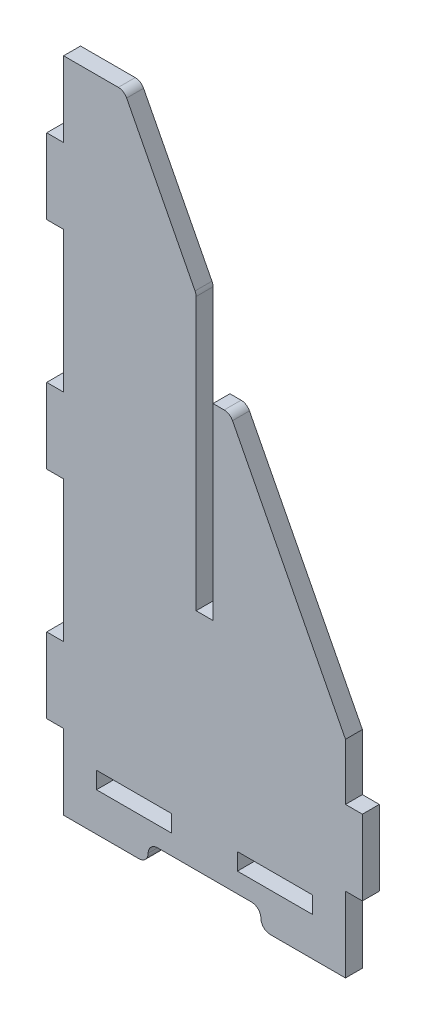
ISO-10303-21;
HEADER;
FILE_DESCRIPTION(('STEP AP214'),'2;1');
FILE_NAME('part.step','',(''),(''),'','','');
FILE_SCHEMA(('AUTOMOTIVE_DESIGN { 1 0 10303 214 1 1 1 1 }'));
ENDSEC;
DATA;
#1=APPLICATION_CONTEXT('core data for automotive mechanical design processes');
#2=APPLICATION_PROTOCOL_DEFINITION('international standard','automotive_design',2000,#1);
#3=PRODUCT_CONTEXT('',#1,'mechanical');
#4=PRODUCT('Part','Part','',(#3));
#5=PRODUCT_RELATED_PRODUCT_CATEGORY('part','',(#4));
#6=PRODUCT_DEFINITION_FORMATION('','',#4);
#7=PRODUCT_DEFINITION_CONTEXT('part definition',#1,'design');
#8=PRODUCT_DEFINITION('design','',#6,#7);
#9=PRODUCT_DEFINITION_SHAPE('','',#8);
#10=(LENGTH_UNIT() NAMED_UNIT(*) SI_UNIT(.MILLI.,.METRE.));
#11=(NAMED_UNIT(*) PLANE_ANGLE_UNIT() SI_UNIT($,.RADIAN.));
#12=(NAMED_UNIT(*) SI_UNIT($,.STERADIAN.) SOLID_ANGLE_UNIT());
#13=UNCERTAINTY_MEASURE_WITH_UNIT(LENGTH_MEASURE(1.E-05),#10,'distance_accuracy_value','');
#14=(GEOMETRIC_REPRESENTATION_CONTEXT(3) GLOBAL_UNCERTAINTY_ASSIGNED_CONTEXT((#13)) GLOBAL_UNIT_ASSIGNED_CONTEXT((#10,
#11,#12)) REPRESENTATION_CONTEXT('',''));
#15=CARTESIAN_POINT('',(0.,0.,0.));
#16=DIRECTION('',(0.,0.,1.));
#17=DIRECTION('',(1.,0.,0.));
#18=AXIS2_PLACEMENT_3D('',#15,#16,#17);
#19=CARTESIAN_POINT('',(-150.,350.,18.));
#20=DIRECTION('',(1.,0.,0.));
#21=DIRECTION('',(0.,1.,0.));
#22=AXIS2_PLACEMENT_3D('',#19,#20,#21);
#23=PLANE('',#22);
#24=DIRECTION('',(0.,-1.,0.));
#25=VECTOR('',#24,1.);
#26=CARTESIAN_POINT('',(-150.,350.,18.));
#27=LINE('',#26,#25);
#28=CARTESIAN_POINT('',(-150.,190.,18.));
#29=VERTEX_POINT('',#28);
#30=CARTESIAN_POINT('',(-150.,40.,18.));
#31=VERTEX_POINT('',#30);
#32=EDGE_CURVE('E545',#29,#31,#27,.T.);
#33=ORIENTED_EDGE('',*,*,#32,.F.);
#34=DIRECTION('',(0.,0.,-1.));
#35=VECTOR('',#34,1.);
#36=CARTESIAN_POINT('',(-150.,190.,18.));
#37=LINE('',#36,#35);
#38=CARTESIAN_POINT('',(-150.,190.,0.));
#39=VERTEX_POINT('',#38);
#40=EDGE_CURVE('E358',#29,#39,#37,.T.);
#41=ORIENTED_EDGE('',*,*,#40,.T.);
#42=DIRECTION('',(0.,-1.,0.));
#43=VECTOR('',#42,1.);
#44=CARTESIAN_POINT('',(-150.,350.,0.));
#45=LINE('',#44,#43);
#46=CARTESIAN_POINT('',(-150.,40.,0.));
#47=VERTEX_POINT('',#46);
#48=EDGE_CURVE('E565',#39,#47,#45,.T.);
#49=ORIENTED_EDGE('',*,*,#48,.T.);
#50=DIRECTION('',(0.,0.,-1.));
#51=VECTOR('',#50,1.);
#52=CARTESIAN_POINT('',(-150.,40.,18.));
#53=LINE('',#52,#51);
#54=EDGE_CURVE('E386',#31,#47,#53,.T.);
#55=ORIENTED_EDGE('',*,*,#54,.F.);
#56=EDGE_LOOP('',(#33,#41,#49,#55));
#57=FACE_BOUND('',#56,.T.);
#58=ADVANCED_FACE('F33',(#57),#23,.F.);
#59=CARTESIAN_POINT('',(-150.,350.,0.));
#60=VERTEX_POINT('',#59);
#61=CARTESIAN_POINT('',(-150.,270.,0.));
#62=VERTEX_POINT('',#61);
#63=EDGE_CURVE('E563',#60,#62,#45,.T.);
#64=ORIENTED_EDGE('',*,*,#63,.T.);
#65=DIRECTION('',(0.,0.,-1.));
#66=VECTOR('',#65,1.);
#67=CARTESIAN_POINT('',(-150.,270.,18.));
#68=LINE('',#67,#66);
#69=CARTESIAN_POINT('',(-150.,270.,18.));
#70=VERTEX_POINT('',#69);
#71=EDGE_CURVE('E362',#70,#62,#68,.T.);
#72=ORIENTED_EDGE('',*,*,#71,.F.);
#73=CARTESIAN_POINT('',(-150.,350.,18.));
#74=VERTEX_POINT('',#73);
#75=EDGE_CURVE('E541',#74,#70,#27,.T.);
#76=ORIENTED_EDGE('',*,*,#75,.F.);
#77=DIRECTION('',(0.,0.,-1.));
#78=VECTOR('',#77,1.);
#79=CARTESIAN_POINT('',(-150.,350.,18.));
#80=LINE('',#79,#78);
#81=EDGE_CURVE('E568',#74,#60,#80,.T.);
#82=ORIENTED_EDGE('',*,*,#81,.T.);
#83=EDGE_LOOP('',(#64,#72,#76,#82));
#84=FACE_BOUND('',#83,.T.);
#85=ADVANCED_FACE('F747',(#84),#23,.F.);
#86=DIRECTION('',(0.,0.,1.));
#87=VECTOR('',#86,1.);
#88=CARTESIAN_POINT('',(-150.,-270.,0.));
#89=LINE('',#88,#87);
#90=CARTESIAN_POINT('',(-150.,-270.,0.));
#91=VERTEX_POINT('',#90);
#92=CARTESIAN_POINT('',(-150.,-270.,18.));
#93=VERTEX_POINT('',#92);
#94=EDGE_CURVE('E481',#91,#93,#89,.T.);
#95=ORIENTED_EDGE('',*,*,#94,.F.);
#96=CARTESIAN_POINT('',(-150.,-350.,0.));
#97=VERTEX_POINT('',#96);
#98=EDGE_CURVE('E562',#91,#97,#45,.T.);
#99=ORIENTED_EDGE('',*,*,#98,.T.);
#100=DIRECTION('',(0.,0.,-1.));
#101=VECTOR('',#100,1.);
#102=CARTESIAN_POINT('',(-150.,-350.,18.));
#103=LINE('',#102,#101);
#104=CARTESIAN_POINT('',(-150.,-350.,18.));
#105=VERTEX_POINT('',#104);
#106=EDGE_CURVE('E544',#105,#97,#103,.T.);
#107=ORIENTED_EDGE('',*,*,#106,.F.);
#108=EDGE_CURVE('E540',#93,#105,#27,.T.);
#109=ORIENTED_EDGE('',*,*,#108,.F.);
#110=EDGE_LOOP('',(#95,#99,#107,#109));
#111=FACE_BOUND('',#110,.T.);
#112=ADVANCED_FACE('F704',(#111),#23,.F.);
#113=CARTESIAN_POINT('',(150.,-350.,18.));
#114=DIRECTION('',(-1.,0.,0.));
#115=DIRECTION('',(0.,-1.,0.));
#116=AXIS2_PLACEMENT_3D('',#113,#114,#115);
#117=PLANE('',#116);
#118=DIRECTION('',(0.,0.,1.));
#119=VECTOR('',#118,1.);
#120=CARTESIAN_POINT('',(150.,-190.,0.));
#121=LINE('',#120,#119);
#122=CARTESIAN_POINT('',(150.,-190.,0.));
#123=VERTEX_POINT('',#122);
#124=CARTESIAN_POINT('',(150.,-190.,18.));
#125=VERTEX_POINT('',#124);
#126=EDGE_CURVE('E503',#123,#125,#121,.T.);
#127=ORIENTED_EDGE('',*,*,#126,.F.);
#128=DIRECTION('',(0.,1.,0.));
#129=VECTOR('',#128,1.);
#130=CARTESIAN_POINT('',(150.,-350.,0.));
#131=LINE('',#130,#129);
#132=CARTESIAN_POINT('',(150.,-130.,0.));
#133=VERTEX_POINT('',#132);
#134=EDGE_CURVE('E549',#123,#133,#131,.T.);
#135=ORIENTED_EDGE('',*,*,#134,.T.);
#136=DIRECTION('',(0.,0.,-1.));
#137=VECTOR('',#136,1.);
#138=CARTESIAN_POINT('',(150.,-130.,18.));
#139=LINE('',#138,#137);
#140=CARTESIAN_POINT('',(150.,-130.,18.));
#141=VERTEX_POINT('',#140);
#142=EDGE_CURVE('E571',#141,#133,#139,.T.);
#143=ORIENTED_EDGE('',*,*,#142,.F.);
#144=DIRECTION('',(0.,1.,0.));
#145=VECTOR('',#144,1.);
#146=CARTESIAN_POINT('',(150.,-350.,18.));
#147=LINE('',#146,#145);
#148=EDGE_CURVE('E523',#125,#141,#147,.T.);
#149=ORIENTED_EDGE('',*,*,#148,.F.);
#150=EDGE_LOOP('',(#127,#135,#143,#149));
#151=FACE_BOUND('',#150,.T.);
#152=ADVANCED_FACE('F649',(#151),#117,.F.);
#153=CARTESIAN_POINT('',(-150.,-350.,18.));
#154=DIRECTION('',(0.,1.,0.));
#155=DIRECTION('',(0.,0.,1.));
#156=AXIS2_PLACEMENT_3D('',#153,#154,#155);
#157=PLANE('',#156);
#158=DIRECTION('',(1.,0.,0.));
#159=VECTOR('',#158,1.);
#160=CARTESIAN_POINT('',(-150.,-350.,18.));
#161=LINE('',#160,#159);
#162=CARTESIAN_POINT('',(70.,-350.,18.));
#163=VERTEX_POINT('',#162);
#164=CARTESIAN_POINT('',(150.,-350.,18.));
#165=VERTEX_POINT('',#164);
#166=EDGE_CURVE('E524',#163,#165,#161,.T.);
#167=ORIENTED_EDGE('',*,*,#166,.F.);
#168=DIRECTION('',(0.,0.,1.));
#169=VECTOR('',#168,1.);
#170=CARTESIAN_POINT('',(70.,-350.,18.));
#171=LINE('',#170,#169);
#172=CARTESIAN_POINT('',(70.,-350.,0.));
#173=VERTEX_POINT('',#172);
#174=EDGE_CURVE('E586',#163,#173,#171,.F.);
#175=ORIENTED_EDGE('',*,*,#174,.T.);
#176=DIRECTION('',(1.,0.,0.));
#177=VECTOR('',#176,1.);
#178=CARTESIAN_POINT('',(-150.,-350.,0.));
#179=LINE('',#178,#177);
#180=CARTESIAN_POINT('',(150.,-350.,0.));
#181=VERTEX_POINT('',#180);
#182=EDGE_CURVE('E515',#173,#181,#179,.T.);
#183=ORIENTED_EDGE('',*,*,#182,.T.);
#184=DIRECTION('',(0.,0.,-1.));
#185=VECTOR('',#184,1.);
#186=CARTESIAN_POINT('',(150.,-350.,18.));
#187=LINE('',#186,#185);
#188=EDGE_CURVE('E574',#165,#181,#187,.T.);
#189=ORIENTED_EDGE('',*,*,#188,.F.);
#190=EDGE_LOOP('',(#167,#175,#183,#189));
#191=FACE_BOUND('',#190,.T.);
#192=ADVANCED_FACE('F668',(#191),#157,.F.);
#193=CARTESIAN_POINT('',(-70.,-350.,0.));
#194=VERTEX_POINT('',#193);
#195=EDGE_CURVE('E546',#97,#194,#179,.T.);
#196=ORIENTED_EDGE('',*,*,#195,.T.);
#197=DIRECTION('',(0.,0.,1.));
#198=VECTOR('',#197,1.);
#199=CARTESIAN_POINT('',(-70.,-350.,18.));
#200=LINE('',#199,#198);
#201=CARTESIAN_POINT('',(-70.,-350.,18.));
#202=VERTEX_POINT('',#201);
#203=EDGE_CURVE('E592',#194,#202,#200,.T.);
#204=ORIENTED_EDGE('',*,*,#203,.T.);
#205=EDGE_CURVE('E520',#105,#202,#161,.T.);
#206=ORIENTED_EDGE('',*,*,#205,.F.);
#207=ORIENTED_EDGE('',*,*,#106,.T.);
#208=EDGE_LOOP('',(#196,#204,#206,#207));
#209=FACE_BOUND('',#208,.T.);
#210=ADVANCED_FACE('F695',(#209),#157,.F.);
#211=CARTESIAN_POINT('',(150.,-270.,0.));
#212=VERTEX_POINT('',#211);
#213=EDGE_CURVE('E550',#181,#212,#131,.T.);
#214=ORIENTED_EDGE('',*,*,#213,.T.);
#215=DIRECTION('',(0.,0.,1.));
#216=VECTOR('',#215,1.);
#217=CARTESIAN_POINT('',(150.,-270.,0.));
#218=LINE('',#217,#216);
#219=CARTESIAN_POINT('',(150.,-270.,18.));
#220=VERTEX_POINT('',#219);
#221=EDGE_CURVE('E495',#212,#220,#218,.T.);
#222=ORIENTED_EDGE('',*,*,#221,.T.);
#223=EDGE_CURVE('E525',#165,#220,#147,.T.);
#224=ORIENTED_EDGE('',*,*,#223,.F.);
#225=ORIENTED_EDGE('',*,*,#188,.T.);
#226=EDGE_LOOP('',(#214,#222,#224,#225));
#227=FACE_BOUND('',#226,.T.);
#228=ADVANCED_FACE('F663',(#227),#117,.F.);
#229=CARTESIAN_POINT('',(150.,-130.,18.));
#230=DIRECTION('',(-0.889158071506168,-0.45760017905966,0.));
#231=DIRECTION('',(0.45760017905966,-0.889158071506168,0.));
#232=AXIS2_PLACEMENT_3D('',#229,#230,#231);
#233=PLANE('',#232);
#234=DIRECTION('',(-0.45760017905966,0.889158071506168,0.));
#235=VECTOR('',#234,1.);
#236=CARTESIAN_POINT('',(150.,-130.,0.));
#237=LINE('',#236,#235);
#238=CARTESIAN_POINT('',(29.7914300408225,103.576001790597,0.));
#239=VERTEX_POINT('',#238);
#240=EDGE_CURVE('E553',#133,#239,#237,.T.);
#241=ORIENTED_EDGE('',*,*,#240,.T.);
#242=DIRECTION('',(0.,0.,-1.));
#243=VECTOR('',#242,1.);
#244=CARTESIAN_POINT('',(29.7914300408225,103.576001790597,18.));
#245=LINE('',#244,#243);
#246=CARTESIAN_POINT('',(29.7914300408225,103.576001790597,18.));
#247=VERTEX_POINT('',#246);
#248=EDGE_CURVE('E11',#239,#247,#245,.F.);
#249=ORIENTED_EDGE('',*,*,#248,.T.);
#250=DIRECTION('',(-0.45760017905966,0.889158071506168,0.));
#251=VECTOR('',#250,1.);
#252=CARTESIAN_POINT('',(150.,-130.,18.));
#253=LINE('',#252,#251);
#254=EDGE_CURVE('E528',#141,#247,#253,.T.);
#255=ORIENTED_EDGE('',*,*,#254,.F.);
#256=ORIENTED_EDGE('',*,*,#142,.T.);
#257=EDGE_LOOP('',(#241,#249,#255,#256));
#258=FACE_BOUND('',#257,.T.);
#259=ADVANCED_FACE('F638',(#258),#233,.F.);
#260=CARTESIAN_POINT('',(26.9999999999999,109.,18.));
#261=DIRECTION('',(0.,-1.,0.));
#262=DIRECTION('',(1.,0.,0.));
#263=AXIS2_PLACEMENT_3D('',#260,#261,#262);
#264=PLANE('',#263);
#265=DIRECTION('',(-1.,0.,0.));
#266=VECTOR('',#265,1.);
#267=CARTESIAN_POINT('',(26.9999999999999,109.,0.));
#268=LINE('',#267,#266);
#269=CARTESIAN_POINT('',(20.8998493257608,109.,0.));
#270=VERTEX_POINT('',#269);
#271=CARTESIAN_POINT('',(8.99999999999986,109.,0.));
#272=VERTEX_POINT('',#271);
#273=EDGE_CURVE('E316',#270,#272,#268,.T.);
#274=ORIENTED_EDGE('',*,*,#273,.T.);
#275=DIRECTION('',(0.,0.,1.));
#276=VECTOR('',#275,1.);
#277=CARTESIAN_POINT('',(8.99999999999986,109.,0.));
#278=LINE('',#277,#276);
#279=CARTESIAN_POINT('',(8.99999999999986,109.,18.));
#280=VERTEX_POINT('',#279);
#281=EDGE_CURVE('E335',#272,#280,#278,.T.);
#282=ORIENTED_EDGE('',*,*,#281,.T.);
#283=DIRECTION('',(-1.,0.,0.));
#284=VECTOR('',#283,1.);
#285=CARTESIAN_POINT('',(26.9999999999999,109.,18.));
#286=LINE('',#285,#284);
#287=CARTESIAN_POINT('',(20.8998493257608,109.,18.));
#288=VERTEX_POINT('',#287);
#289=EDGE_CURVE('E531',#288,#280,#286,.T.);
#290=ORIENTED_EDGE('',*,*,#289,.F.);
#291=DIRECTION('',(0.,0.,-1.));
#292=VECTOR('',#291,1.);
#293=CARTESIAN_POINT('',(20.8998493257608,109.,18.));
#294=LINE('',#293,#292);
#295=EDGE_CURVE('E41',#288,#270,#294,.T.);
#296=ORIENTED_EDGE('',*,*,#295,.T.);
#297=EDGE_LOOP('',(#274,#282,#290,#296));
#298=FACE_BOUND('',#297,.T.);
#299=ADVANCED_FACE('F631',(#298),#264,.F.);
#300=CARTESIAN_POINT('',(-9.00000000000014,109.,18.));
#301=DIRECTION('',(-1.,0.,0.));
#302=DIRECTION('',(0.,0.,1.));
#303=AXIS2_PLACEMENT_3D('',#300,#301,#302);
#304=PLANE('',#303);
#305=DIRECTION('',(0.,1.,0.));
#306=VECTOR('',#305,1.);
#307=CARTESIAN_POINT('',(-9.00000000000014,109.,0.));
#308=LINE('',#307,#306);
#309=CARTESIAN_POINT('',(-9.00000000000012,-91.,0.));
#310=VERTEX_POINT('',#309);
#311=CARTESIAN_POINT('',(-9.00000000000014,198.594774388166,0.));
#312=VERTEX_POINT('',#311);
#313=EDGE_CURVE('E307',#310,#312,#308,.T.);
#314=ORIENTED_EDGE('',*,*,#313,.T.);
#315=DIRECTION('',(0.,0.,-1.));
#316=VECTOR('',#315,1.);
#317=CARTESIAN_POINT('',(-9.00000000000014,198.594774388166,18.));
#318=LINE('',#317,#316);
#319=CARTESIAN_POINT('',(-9.00000000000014,198.594774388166,18.));
#320=VERTEX_POINT('',#319);
#321=EDGE_CURVE('E56',#312,#320,#318,.F.);
#322=ORIENTED_EDGE('',*,*,#321,.T.);
#323=DIRECTION('',(0.,1.,0.));
#324=VECTOR('',#323,1.);
#325=CARTESIAN_POINT('',(-9.00000000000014,109.,18.));
#326=LINE('',#325,#324);
#327=CARTESIAN_POINT('',(-9.00000000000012,-91.,18.));
#328=VERTEX_POINT('',#327);
#329=EDGE_CURVE('E321',#328,#320,#326,.T.);
#330=ORIENTED_EDGE('',*,*,#329,.F.);
#331=DIRECTION('',(0.,0.,1.));
#332=VECTOR('',#331,1.);
#333=CARTESIAN_POINT('',(-9.00000000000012,-91.,0.));
#334=LINE('',#333,#332);
#335=EDGE_CURVE('E319',#310,#328,#334,.T.);
#336=ORIENTED_EDGE('',*,*,#335,.F.);
#337=EDGE_LOOP('',(#314,#322,#330,#336));
#338=FACE_BOUND('',#337,.T.);
#339=ADVANCED_FACE('F320',(#338),#304,.F.);
#340=CARTESIAN_POINT('',(-9.00000000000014,201.017473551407,18.));
#341=DIRECTION('',(-0.889118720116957,-0.457676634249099,0.));
#342=DIRECTION('',(0.457676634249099,-0.889118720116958,0.));
#343=AXIS2_PLACEMENT_3D('',#340,#341,#342);
#344=PLANE('',#343);
#345=DIRECTION('',(-0.457676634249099,0.889118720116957,0.));
#346=VECTOR('',#345,1.);
#347=CARTESIAN_POINT('',(-9.00000000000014,201.017473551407,0.));
#348=LINE('',#347,#346);
#349=CARTESIAN_POINT('',(-10.1088127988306,203.171540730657,0.));
#350=VERTEX_POINT('',#349);
#351=CARTESIAN_POINT('',(-82.8975937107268,344.576766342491,0.));
#352=VERTEX_POINT('',#351);
#353=EDGE_CURVE('E315',#350,#352,#348,.T.);
#354=ORIENTED_EDGE('',*,*,#353,.T.);
#355=DIRECTION('',(0.,0.,-1.));
#356=VECTOR('',#355,1.);
#357=CARTESIAN_POINT('',(-82.8975937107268,344.576766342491,18.));
#358=LINE('',#357,#356);
#359=CARTESIAN_POINT('',(-82.8975937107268,344.576766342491,18.));
#360=VERTEX_POINT('',#359);
#361=EDGE_CURVE('E618',#352,#360,#358,.F.);
#362=ORIENTED_EDGE('',*,*,#361,.T.);
#363=DIRECTION('',(-0.457676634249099,0.889118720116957,0.));
#364=VECTOR('',#363,1.);
#365=CARTESIAN_POINT('',(-9.00000000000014,201.017473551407,18.));
#366=LINE('',#365,#364);
#367=CARTESIAN_POINT('',(-10.1088127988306,203.171540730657,18.));
#368=VERTEX_POINT('',#367);
#369=EDGE_CURVE('E535',#368,#360,#366,.T.);
#370=ORIENTED_EDGE('',*,*,#369,.F.);
#371=DIRECTION('',(0.,0.,-1.));
#372=VECTOR('',#371,1.);
#373=CARTESIAN_POINT('',(-10.1088127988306,203.171540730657,18.));
#374=LINE('',#373,#372);
#375=EDGE_CURVE('E615',#368,#350,#374,.T.);
#376=ORIENTED_EDGE('',*,*,#375,.T.);
#377=EDGE_LOOP('',(#354,#362,#370,#376));
#378=FACE_BOUND('',#377,.T.);
#379=ADVANCED_FACE('F742',(#378),#344,.F.);
#380=CARTESIAN_POINT('',(-150.,350.,18.));
#381=DIRECTION('',(0.,-1.,0.));
#382=DIRECTION('',(0.,0.,-1.));
#383=AXIS2_PLACEMENT_3D('',#380,#381,#382);
#384=PLANE('',#383);
#385=DIRECTION('',(-1.,0.,0.));
#386=VECTOR('',#385,1.);
#387=CARTESIAN_POINT('',(-150.,350.,18.));
#388=LINE('',#387,#386);
#389=CARTESIAN_POINT('',(-91.7887809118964,350.,18.));
#390=VERTEX_POINT('',#389);
#391=EDGE_CURVE('E538',#390,#74,#388,.T.);
#392=ORIENTED_EDGE('',*,*,#391,.F.);
#393=DIRECTION('',(0.,0.,-1.));
#394=VECTOR('',#393,1.);
#395=CARTESIAN_POINT('',(-91.7887809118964,350.,18.));
#396=LINE('',#395,#394);
#397=CARTESIAN_POINT('',(-91.7887809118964,350.,0.));
#398=VERTEX_POINT('',#397);
#399=EDGE_CURVE('E603',#390,#398,#396,.T.);
#400=ORIENTED_EDGE('',*,*,#399,.T.);
#401=DIRECTION('',(-1.,0.,0.));
#402=VECTOR('',#401,1.);
#403=CARTESIAN_POINT('',(-150.,350.,0.));
#404=LINE('',#403,#402);
#405=EDGE_CURVE('E560',#398,#60,#404,.T.);
#406=ORIENTED_EDGE('',*,*,#405,.T.);
#407=ORIENTED_EDGE('',*,*,#81,.F.);
#408=EDGE_LOOP('',(#392,#400,#406,#407));
#409=FACE_BOUND('',#408,.T.);
#410=ADVANCED_FACE('F733',(#409),#384,.F.);
#411=CARTESIAN_POINT('',(-150.,-40.,18.));
#412=VERTEX_POINT('',#411);
#413=CARTESIAN_POINT('',(-150.,-190.,18.));
#414=VERTEX_POINT('',#413);
#415=EDGE_CURVE('E703',#412,#414,#27,.T.);
#416=ORIENTED_EDGE('',*,*,#415,.F.);
#417=DIRECTION('',(0.,0.,-1.));
#418=VECTOR('',#417,1.);
#419=CARTESIAN_POINT('',(-150.,-40.,18.));
#420=LINE('',#419,#418);
#421=CARTESIAN_POINT('',(-150.,-40.,0.));
#422=VERTEX_POINT('',#421);
#423=EDGE_CURVE('E378',#412,#422,#420,.T.);
#424=ORIENTED_EDGE('',*,*,#423,.T.);
#425=CARTESIAN_POINT('',(-150.,-190.,0.));
#426=VERTEX_POINT('',#425);
#427=EDGE_CURVE('E706',#422,#426,#45,.T.);
#428=ORIENTED_EDGE('',*,*,#427,.T.);
#429=DIRECTION('',(0.,0.,1.));
#430=VECTOR('',#429,1.);
#431=CARTESIAN_POINT('',(-150.,-190.,0.));
#432=LINE('',#431,#430);
#433=EDGE_CURVE('E477',#426,#414,#432,.T.);
#434=ORIENTED_EDGE('',*,*,#433,.T.);
#435=EDGE_LOOP('',(#416,#424,#428,#434));
#436=FACE_BOUND('',#435,.T.);
#437=ADVANCED_FACE('F731',(#436),#23,.F.);
#438=CARTESIAN_POINT('',(0.,0.,18.));
#439=DIRECTION('',(0.,0.,1.));
#440=DIRECTION('',(1.,0.,0.));
#441=AXIS2_PLACEMENT_3D('',#438,#439,#440);
#442=PLANE('',#441);
#443=DIRECTION('',(1.,0.,0.));
#444=VECTOR('',#443,1.);
#445=CARTESIAN_POINT('',(-9.00000000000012,-91.,18.));
#446=LINE('',#445,#444);
#447=CARTESIAN_POINT('',(8.99999999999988,-91.,18.));
#448=VERTEX_POINT('',#447);
#449=EDGE_CURVE('E331',#328,#448,#446,.T.);
#450=ORIENTED_EDGE('',*,*,#449,.F.);
#451=ORIENTED_EDGE('',*,*,#329,.T.);
#452=CARTESIAN_POINT('',(-19.0000000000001,198.594774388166,18.));
#453=DIRECTION('',(0.,0.,1.));
#454=DIRECTION('',(1.,0.,0.));
#455=AXIS2_PLACEMENT_3D('',#452,#453,#454);
#456=CIRCLE('',#455,10.);
#457=EDGE_CURVE('E622',#320,#368,#456,.T.);
#458=ORIENTED_EDGE('',*,*,#457,.T.);
#459=ORIENTED_EDGE('',*,*,#369,.T.);
#460=CARTESIAN_POINT('',(-91.7887809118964,340.,18.));
#461=DIRECTION('',(0.,0.,1.));
#462=DIRECTION('',(1.,0.,0.));
#463=AXIS2_PLACEMENT_3D('',#460,#461,#462);
#464=CIRCLE('',#463,10.);
#465=EDGE_CURVE('E624',#360,#390,#464,.T.);
#466=ORIENTED_EDGE('',*,*,#465,.T.);
#467=ORIENTED_EDGE('',*,*,#391,.T.);
#468=ORIENTED_EDGE('',*,*,#75,.T.);
#469=DIRECTION('',(1.,0.,0.));
#470=VECTOR('',#469,1.);
#471=CARTESIAN_POINT('',(-168.,270.,18.));
#472=LINE('',#471,#470);
#473=CARTESIAN_POINT('',(-168.,270.,18.));
#474=VERTEX_POINT('',#473);
#475=EDGE_CURVE('E347',#474,#70,#472,.T.);
#476=ORIENTED_EDGE('',*,*,#475,.F.);
#477=DIRECTION('',(0.,1.,0.));
#478=VECTOR('',#477,1.);
#479=CARTESIAN_POINT('',(-168.,190.,18.));
#480=LINE('',#479,#478);
#481=CARTESIAN_POINT('',(-168.,190.,18.));
#482=VERTEX_POINT('',#481);
#483=EDGE_CURVE('E343',#482,#474,#480,.T.);
#484=ORIENTED_EDGE('',*,*,#483,.F.);
#485=DIRECTION('',(-1.,0.,0.));
#486=VECTOR('',#485,1.);
#487=CARTESIAN_POINT('',(-168.,190.,18.));
#488=LINE('',#487,#486);
#489=EDGE_CURVE('E340',#29,#482,#488,.T.);
#490=ORIENTED_EDGE('',*,*,#489,.F.);
#491=ORIENTED_EDGE('',*,*,#32,.T.);
#492=DIRECTION('',(1.,0.,0.));
#493=VECTOR('',#492,1.);
#494=CARTESIAN_POINT('',(-168.,40.,18.));
#495=LINE('',#494,#493);
#496=CARTESIAN_POINT('',(-168.,40.,18.));
#497=VERTEX_POINT('',#496);
#498=EDGE_CURVE('E375',#497,#31,#495,.T.);
#499=ORIENTED_EDGE('',*,*,#498,.F.);
#500=DIRECTION('',(0.,1.,0.));
#501=VECTOR('',#500,1.);
#502=CARTESIAN_POINT('',(-168.,40.,18.));
#503=LINE('',#502,#501);
#504=CARTESIAN_POINT('',(-168.,-40.,18.));
#505=VERTEX_POINT('',#504);
#506=EDGE_CURVE('E371',#505,#497,#503,.T.);
#507=ORIENTED_EDGE('',*,*,#506,.F.);
#508=DIRECTION('',(-1.,0.,0.));
#509=VECTOR('',#508,1.);
#510=CARTESIAN_POINT('',(-168.,-40.,18.));
#511=LINE('',#510,#509);
#512=EDGE_CURVE('E368',#412,#505,#511,.T.);
#513=ORIENTED_EDGE('',*,*,#512,.F.);
#514=ORIENTED_EDGE('',*,*,#415,.T.);
#515=DIRECTION('',(-1.,0.,0.));
#516=VECTOR('',#515,1.);
#517=CARTESIAN_POINT('',(-150.,-190.,18.));
#518=LINE('',#517,#516);
#519=CARTESIAN_POINT('',(-168.,-190.,18.));
#520=VERTEX_POINT('',#519);
#521=EDGE_CURVE('E453',#414,#520,#518,.T.);
#522=ORIENTED_EDGE('',*,*,#521,.T.);
#523=DIRECTION('',(0.,-1.,0.));
#524=VECTOR('',#523,1.);
#525=CARTESIAN_POINT('',(-168.,-190.,18.));
#526=LINE('',#525,#524);
#527=CARTESIAN_POINT('',(-168.,-270.,18.));
#528=VERTEX_POINT('',#527);
#529=EDGE_CURVE('E472',#520,#528,#526,.T.);
#530=ORIENTED_EDGE('',*,*,#529,.T.);
#531=DIRECTION('',(1.,0.,0.));
#532=VECTOR('',#531,1.);
#533=CARTESIAN_POINT('',(-150.,-270.,18.));
#534=LINE('',#533,#532);
#535=EDGE_CURVE('E464',#528,#93,#534,.T.);
#536=ORIENTED_EDGE('',*,*,#535,.T.);
#537=ORIENTED_EDGE('',*,*,#108,.T.);
#538=ORIENTED_EDGE('',*,*,#205,.T.);
#539=CARTESIAN_POINT('',(-70.,-340.,18.));
#540=DIRECTION('',(0.,0.,1.));
#541=DIRECTION('',(1.,0.,0.));
#542=AXIS2_PLACEMENT_3D('',#539,#540,#541);
#543=CIRCLE('',#542,10.);
#544=CARTESIAN_POINT('',(-60.,-340.,18.));
#545=VERTEX_POINT('',#544);
#546=EDGE_CURVE('E582',#202,#545,#543,.T.);
#547=ORIENTED_EDGE('',*,*,#546,.T.);
#548=CARTESIAN_POINT('',(-50.,-340.,18.));
#549=DIRECTION('',(0.,0.,1.));
#550=DIRECTION('',(1.,0.,0.));
#551=AXIS2_PLACEMENT_3D('',#548,#549,#550);
#552=CIRCLE('',#551,10.);
#553=CARTESIAN_POINT('',(-50.,-330.,18.));
#554=VERTEX_POINT('',#553);
#555=EDGE_CURVE('E599',#545,#554,#552,.F.);
#556=ORIENTED_EDGE('',*,*,#555,.T.);
#557=DIRECTION('',(-1.,0.,0.));
#558=VECTOR('',#557,1.);
#559=CARTESIAN_POINT('',(-60.,-330.,18.));
#560=LINE('',#559,#558);
#561=CARTESIAN_POINT('',(50.,-330.,18.));
#562=VERTEX_POINT('',#561);
#563=EDGE_CURVE('E516',#562,#554,#560,.T.);
#564=ORIENTED_EDGE('',*,*,#563,.F.);
#565=CARTESIAN_POINT('',(50.,-340.,18.));
#566=DIRECTION('',(0.,0.,1.));
#567=DIRECTION('',(1.,0.,0.));
#568=AXIS2_PLACEMENT_3D('',#565,#566,#567);
#569=CIRCLE('',#568,10.);
#570=CARTESIAN_POINT('',(60.,-340.,18.));
#571=VERTEX_POINT('',#570);
#572=EDGE_CURVE('E595',#562,#571,#569,.F.);
#573=ORIENTED_EDGE('',*,*,#572,.T.);
#574=CARTESIAN_POINT('',(70.,-340.,18.));
#575=DIRECTION('',(0.,0.,1.));
#576=DIRECTION('',(1.,0.,0.));
#577=AXIS2_PLACEMENT_3D('',#574,#575,#576);
#578=CIRCLE('',#577,10.);
#579=EDGE_CURVE('E584',#571,#163,#578,.T.);
#580=ORIENTED_EDGE('',*,*,#579,.T.);
#581=ORIENTED_EDGE('',*,*,#166,.T.);
#582=ORIENTED_EDGE('',*,*,#223,.T.);
#583=DIRECTION('',(1.,0.,0.));
#584=VECTOR('',#583,1.);
#585=CARTESIAN_POINT('',(150.,-270.,18.));
#586=LINE('',#585,#584);
#587=CARTESIAN_POINT('',(168.,-270.,18.));
#588=VERTEX_POINT('',#587);
#589=EDGE_CURVE('E480',#220,#588,#586,.T.);
#590=ORIENTED_EDGE('',*,*,#589,.T.);
#591=DIRECTION('',(0.,1.,0.));
#592=VECTOR('',#591,1.);
#593=CARTESIAN_POINT('',(168.,-190.,18.));
#594=LINE('',#593,#592);
#595=CARTESIAN_POINT('',(168.,-190.,18.));
#596=VERTEX_POINT('',#595);
#597=EDGE_CURVE('E498',#588,#596,#594,.T.);
#598=ORIENTED_EDGE('',*,*,#597,.T.);
#599=DIRECTION('',(-1.,0.,0.));
#600=VECTOR('',#599,1.);
#601=CARTESIAN_POINT('',(150.,-190.,18.));
#602=LINE('',#601,#600);
#603=EDGE_CURVE('E490',#596,#125,#602,.T.);
#604=ORIENTED_EDGE('',*,*,#603,.T.);
#605=ORIENTED_EDGE('',*,*,#148,.T.);
#606=ORIENTED_EDGE('',*,*,#254,.T.);
#607=CARTESIAN_POINT('',(20.8998493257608,99.,18.));
#608=DIRECTION('',(0.,0.,1.));
#609=DIRECTION('',(1.,0.,0.));
#610=AXIS2_PLACEMENT_3D('',#607,#608,#609);
#611=CIRCLE('',#610,10.);
#612=EDGE_CURVE('E620',#247,#288,#611,.T.);
#613=ORIENTED_EDGE('',*,*,#612,.T.);
#614=ORIENTED_EDGE('',*,*,#289,.T.);
#615=DIRECTION('',(0.,1.,0.));
#616=VECTOR('',#615,1.);
#617=CARTESIAN_POINT('',(8.99999999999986,109.,18.));
#618=LINE('',#617,#616);
#619=EDGE_CURVE('E328',#448,#280,#618,.T.);
#620=ORIENTED_EDGE('',*,*,#619,.F.);
#621=EDGE_LOOP('',(#450,#451,#458,#459,#466,#467,#468,#476,#484,#490,#491,#499,#507,#513,#514,
#522,#530,#536,#537,#538,#547,#556,#564,#573,#580,#581,#582,#590,#598,#604,#605,#606,#613,#614,#620));
#622=FACE_BOUND('',#621,.T.);
#623=DIRECTION('',(0.,1.,0.));
#624=VECTOR('',#623,1.);
#625=CARTESIAN_POINT('',(-115.,-291.,18.));
#626=LINE('',#625,#624);
#627=CARTESIAN_POINT('',(-115.,-309.,18.));
#628=VERTEX_POINT('',#627);
#629=CARTESIAN_POINT('',(-115.,-291.,18.));
#630=VERTEX_POINT('',#629);
#631=EDGE_CURVE('E396',#628,#630,#626,.T.);
#632=ORIENTED_EDGE('',*,*,#631,.T.);
#633=DIRECTION('',(1.,0.,0.));
#634=VECTOR('',#633,1.);
#635=CARTESIAN_POINT('',(-115.,-291.,18.));
#636=LINE('',#635,#634);
#637=CARTESIAN_POINT('',(-35.,-291.,18.));
#638=VERTEX_POINT('',#637);
#639=EDGE_CURVE('E399',#630,#638,#636,.T.);
#640=ORIENTED_EDGE('',*,*,#639,.T.);
#641=DIRECTION('',(0.,-1.,0.));
#642=VECTOR('',#641,1.);
#643=CARTESIAN_POINT('',(-35.,-291.,18.));
#644=LINE('',#643,#642);
#645=CARTESIAN_POINT('',(-35.,-309.,18.));
#646=VERTEX_POINT('',#645);
#647=EDGE_CURVE('E403',#638,#646,#644,.T.);
#648=ORIENTED_EDGE('',*,*,#647,.T.);
#649=DIRECTION('',(-1.,0.,0.));
#650=VECTOR('',#649,1.);
#651=CARTESIAN_POINT('',(-115.,-309.,18.));
#652=LINE('',#651,#650);
#653=EDGE_CURVE('E406',#646,#628,#652,.T.);
#654=ORIENTED_EDGE('',*,*,#653,.T.);
#655=EDGE_LOOP('',(#632,#640,#648,#654));
#656=FACE_BOUND('',#655,.T.);
#657=DIRECTION('',(0.,1.,0.));
#658=VECTOR('',#657,1.);
#659=CARTESIAN_POINT('',(35.,-291.,18.));
#660=LINE('',#659,#658);
#661=CARTESIAN_POINT('',(35.,-309.,18.));
#662=VERTEX_POINT('',#661);
#663=CARTESIAN_POINT('',(35.,-291.,18.));
#664=VERTEX_POINT('',#663);
#665=EDGE_CURVE('E428',#662,#664,#660,.T.);
#666=ORIENTED_EDGE('',*,*,#665,.T.);
#667=DIRECTION('',(1.,0.,0.));
#668=VECTOR('',#667,1.);
#669=CARTESIAN_POINT('',(115.,-291.,18.));
#670=LINE('',#669,#668);
#671=CARTESIAN_POINT('',(115.,-291.,18.));
#672=VERTEX_POINT('',#671);
#673=EDGE_CURVE('E431',#664,#672,#670,.T.);
#674=ORIENTED_EDGE('',*,*,#673,.T.);
#675=DIRECTION('',(0.,-1.,0.));
#676=VECTOR('',#675,1.);
#677=CARTESIAN_POINT('',(115.,-291.,18.));
#678=LINE('',#677,#676);
#679=CARTESIAN_POINT('',(115.,-309.,18.));
#680=VERTEX_POINT('',#679);
#681=EDGE_CURVE('E435',#672,#680,#678,.T.);
#682=ORIENTED_EDGE('',*,*,#681,.T.);
#683=DIRECTION('',(-1.,0.,0.));
#684=VECTOR('',#683,1.);
#685=CARTESIAN_POINT('',(115.,-309.,18.));
#686=LINE('',#685,#684);
#687=EDGE_CURVE('E438',#680,#662,#686,.T.);
#688=ORIENTED_EDGE('',*,*,#687,.T.);
#689=EDGE_LOOP('',(#666,#674,#682,#688));
#690=FACE_BOUND('',#689,.T.);
#691=ADVANCED_FACE('F642',(#622,#656,#690),#442,.T.);
#692=CARTESIAN_POINT('',(0.,0.,0.));
#693=DIRECTION('',(0.,0.,1.));
#694=DIRECTION('',(1.,0.,0.));
#695=AXIS2_PLACEMENT_3D('',#692,#693,#694);
#696=PLANE('',#695);
#697=ORIENTED_EDGE('',*,*,#313,.F.);
#698=DIRECTION('',(1.,0.,0.));
#699=VECTOR('',#698,1.);
#700=CARTESIAN_POINT('',(-9.00000000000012,-91.,0.));
#701=LINE('',#700,#699);
#702=CARTESIAN_POINT('',(8.99999999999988,-91.,0.));
#703=VERTEX_POINT('',#702);
#704=EDGE_CURVE('E312',#310,#703,#701,.T.);
#705=ORIENTED_EDGE('',*,*,#704,.T.);
#706=DIRECTION('',(0.,1.,0.));
#707=VECTOR('',#706,1.);
#708=CARTESIAN_POINT('',(8.99999999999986,109.,0.));
#709=LINE('',#708,#707);
#710=EDGE_CURVE('E48',#703,#272,#709,.T.);
#711=ORIENTED_EDGE('',*,*,#710,.T.);
#712=ORIENTED_EDGE('',*,*,#273,.F.);
#713=CARTESIAN_POINT('',(20.8998493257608,99.,0.));
#714=DIRECTION('',(0.,0.,1.));
#715=DIRECTION('',(1.,0.,0.));
#716=AXIS2_PLACEMENT_3D('',#713,#714,#715);
#717=CIRCLE('',#716,10.);
#718=EDGE_CURVE('E610',#270,#239,#717,.F.);
#719=ORIENTED_EDGE('',*,*,#718,.T.);
#720=ORIENTED_EDGE('',*,*,#240,.F.);
#721=ORIENTED_EDGE('',*,*,#134,.F.);
#722=DIRECTION('',(-1.,0.,0.));
#723=VECTOR('',#722,1.);
#724=CARTESIAN_POINT('',(150.,-190.,0.));
#725=LINE('',#724,#723);
#726=CARTESIAN_POINT('',(168.,-190.,0.));
#727=VERTEX_POINT('',#726);
#728=EDGE_CURVE('E493',#727,#123,#725,.T.);
#729=ORIENTED_EDGE('',*,*,#728,.F.);
#730=DIRECTION('',(0.,1.,0.));
#731=VECTOR('',#730,1.);
#732=CARTESIAN_POINT('',(168.,-190.,0.));
#733=LINE('',#732,#731);
#734=CARTESIAN_POINT('',(168.,-270.,0.));
#735=VERTEX_POINT('',#734);
#736=EDGE_CURVE('E489',#735,#727,#733,.T.);
#737=ORIENTED_EDGE('',*,*,#736,.F.);
#738=DIRECTION('',(1.,0.,0.));
#739=VECTOR('',#738,1.);
#740=CARTESIAN_POINT('',(150.,-270.,0.));
#741=LINE('',#740,#739);
#742=EDGE_CURVE('E486',#212,#735,#741,.T.);
#743=ORIENTED_EDGE('',*,*,#742,.F.);
#744=ORIENTED_EDGE('',*,*,#213,.F.);
#745=ORIENTED_EDGE('',*,*,#182,.F.);
#746=CARTESIAN_POINT('',(70.,-340.,0.));
#747=DIRECTION('',(0.,0.,1.));
#748=DIRECTION('',(1.,0.,0.));
#749=AXIS2_PLACEMENT_3D('',#746,#747,#748);
#750=CIRCLE('',#749,10.);
#751=CARTESIAN_POINT('',(60.,-340.,0.));
#752=VERTEX_POINT('',#751);
#753=EDGE_CURVE('E590',#173,#752,#750,.F.);
#754=ORIENTED_EDGE('',*,*,#753,.T.);
#755=CARTESIAN_POINT('',(50.,-340.,0.));
#756=DIRECTION('',(0.,0.,1.));
#757=DIRECTION('',(1.,0.,0.));
#758=AXIS2_PLACEMENT_3D('',#755,#756,#757);
#759=CIRCLE('',#758,10.);
#760=CARTESIAN_POINT('',(50.,-330.,0.));
#761=VERTEX_POINT('',#760);
#762=EDGE_CURVE('E597',#752,#761,#759,.T.);
#763=ORIENTED_EDGE('',*,*,#762,.T.);
#764=DIRECTION('',(-1.,0.,0.));
#765=VECTOR('',#764,1.);
#766=CARTESIAN_POINT('',(-60.,-330.,0.));
#767=LINE('',#766,#765);
#768=CARTESIAN_POINT('',(-50.,-330.,0.));
#769=VERTEX_POINT('',#768);
#770=EDGE_CURVE('E512',#761,#769,#767,.T.);
#771=ORIENTED_EDGE('',*,*,#770,.T.);
#772=CARTESIAN_POINT('',(-50.,-340.,0.));
#773=DIRECTION('',(0.,0.,1.));
#774=DIRECTION('',(1.,0.,0.));
#775=AXIS2_PLACEMENT_3D('',#772,#773,#774);
#776=CIRCLE('',#775,10.);
#777=CARTESIAN_POINT('',(-60.,-340.,0.));
#778=VERTEX_POINT('',#777);
#779=EDGE_CURVE('E601',#769,#778,#776,.T.);
#780=ORIENTED_EDGE('',*,*,#779,.T.);
#781=CARTESIAN_POINT('',(-70.,-340.,0.));
#782=DIRECTION('',(0.,0.,1.));
#783=DIRECTION('',(1.,0.,0.));
#784=AXIS2_PLACEMENT_3D('',#781,#782,#783);
#785=CIRCLE('',#784,10.);
#786=EDGE_CURVE('E588',#778,#194,#785,.F.);
#787=ORIENTED_EDGE('',*,*,#786,.T.);
#788=ORIENTED_EDGE('',*,*,#195,.F.);
#789=ORIENTED_EDGE('',*,*,#98,.F.);
#790=DIRECTION('',(1.,0.,0.));
#791=VECTOR('',#790,1.);
#792=CARTESIAN_POINT('',(-150.,-270.,0.));
#793=LINE('',#792,#791);
#794=CARTESIAN_POINT('',(-168.,-270.,0.));
#795=VERTEX_POINT('',#794);
#796=EDGE_CURVE('E467',#795,#91,#793,.T.);
#797=ORIENTED_EDGE('',*,*,#796,.F.);
#798=DIRECTION('',(0.,-1.,0.));
#799=VECTOR('',#798,1.);
#800=CARTESIAN_POINT('',(-168.,-190.,0.));
#801=LINE('',#800,#799);
#802=CARTESIAN_POINT('',(-168.,-190.,0.));
#803=VERTEX_POINT('',#802);
#804=EDGE_CURVE('E463',#803,#795,#801,.T.);
#805=ORIENTED_EDGE('',*,*,#804,.F.);
#806=DIRECTION('',(-1.,0.,0.));
#807=VECTOR('',#806,1.);
#808=CARTESIAN_POINT('',(-150.,-190.,0.));
#809=LINE('',#808,#807);
#810=EDGE_CURVE('E460',#426,#803,#809,.T.);
#811=ORIENTED_EDGE('',*,*,#810,.F.);
#812=ORIENTED_EDGE('',*,*,#427,.F.);
#813=DIRECTION('',(-1.,0.,0.));
#814=VECTOR('',#813,1.);
#815=CARTESIAN_POINT('',(-168.,-40.,0.));
#816=LINE('',#815,#814);
#817=CARTESIAN_POINT('',(-168.,-40.,0.));
#818=VERTEX_POINT('',#817);
#819=EDGE_CURVE('E361',#422,#818,#816,.T.);
#820=ORIENTED_EDGE('',*,*,#819,.T.);
#821=DIRECTION('',(0.,1.,0.));
#822=VECTOR('',#821,1.);
#823=CARTESIAN_POINT('',(-168.,40.,0.));
#824=LINE('',#823,#822);
#825=CARTESIAN_POINT('',(-168.,40.,0.));
#826=VERTEX_POINT('',#825);
#827=EDGE_CURVE('E381',#818,#826,#824,.T.);
#828=ORIENTED_EDGE('',*,*,#827,.T.);
#829=DIRECTION('',(1.,0.,0.));
#830=VECTOR('',#829,1.);
#831=CARTESIAN_POINT('',(-168.,40.,0.));
#832=LINE('',#831,#830);
#833=EDGE_CURVE('E372',#826,#47,#832,.T.);
#834=ORIENTED_EDGE('',*,*,#833,.T.);
#835=ORIENTED_EDGE('',*,*,#48,.F.);
#836=DIRECTION('',(-1.,0.,0.));
#837=VECTOR('',#836,1.);
#838=CARTESIAN_POINT('',(-168.,190.,0.));
#839=LINE('',#838,#837);
#840=CARTESIAN_POINT('',(-168.,190.,0.));
#841=VERTEX_POINT('',#840);
#842=EDGE_CURVE('E338',#39,#841,#839,.T.);
#843=ORIENTED_EDGE('',*,*,#842,.T.);
#844=DIRECTION('',(0.,1.,0.));
#845=VECTOR('',#844,1.);
#846=CARTESIAN_POINT('',(-168.,190.,0.));
#847=LINE('',#846,#845);
#848=CARTESIAN_POINT('',(-168.,270.,0.));
#849=VERTEX_POINT('',#848);
#850=EDGE_CURVE('E353',#841,#849,#847,.T.);
#851=ORIENTED_EDGE('',*,*,#850,.T.);
#852=DIRECTION('',(1.,0.,0.));
#853=VECTOR('',#852,1.);
#854=CARTESIAN_POINT('',(-168.,270.,0.));
#855=LINE('',#854,#853);
#856=EDGE_CURVE('E344',#849,#62,#855,.T.);
#857=ORIENTED_EDGE('',*,*,#856,.T.);
#858=ORIENTED_EDGE('',*,*,#63,.F.);
#859=ORIENTED_EDGE('',*,*,#405,.F.);
#860=CARTESIAN_POINT('',(-91.7887809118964,340.,0.));
#861=DIRECTION('',(0.,0.,1.));
#862=DIRECTION('',(1.,0.,0.));
#863=AXIS2_PLACEMENT_3D('',#860,#861,#862);
#864=CIRCLE('',#863,10.);
#865=EDGE_CURVE('E613',#398,#352,#864,.F.);
#866=ORIENTED_EDGE('',*,*,#865,.T.);
#867=ORIENTED_EDGE('',*,*,#353,.F.);
#868=CARTESIAN_POINT('',(-19.0000000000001,198.594774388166,0.));
#869=DIRECTION('',(0.,0.,1.));
#870=DIRECTION('',(1.,0.,0.));
#871=AXIS2_PLACEMENT_3D('',#868,#869,#870);
#872=CIRCLE('',#871,10.);
#873=EDGE_CURVE('E314',#350,#312,#872,.F.);
#874=ORIENTED_EDGE('',*,*,#873,.T.);
#875=EDGE_LOOP('',(#697,#705,#711,#712,#719,#720,#721,#729,#737,#743,#744,#745,#754,#763,#771,
#780,#787,#788,#789,#797,#805,#811,#812,#820,#828,#834,#835,#843,#851,#857,#858,#859,#866,#867,#874));
#876=FACE_BOUND('',#875,.T.);
#877=DIRECTION('',(1.,0.,0.));
#878=VECTOR('',#877,1.);
#879=CARTESIAN_POINT('',(-115.,-291.,0.));
#880=LINE('',#879,#878);
#881=CARTESIAN_POINT('',(-115.,-291.,0.));
#882=VERTEX_POINT('',#881);
#883=CARTESIAN_POINT('',(-35.,-291.,0.));
#884=VERTEX_POINT('',#883);
#885=EDGE_CURVE('E411',#882,#884,#880,.T.);
#886=ORIENTED_EDGE('',*,*,#885,.F.);
#887=DIRECTION('',(0.,1.,0.));
#888=VECTOR('',#887,1.);
#889=CARTESIAN_POINT('',(-115.,-291.,0.));
#890=LINE('',#889,#888);
#891=CARTESIAN_POINT('',(-115.,-309.,0.));
#892=VERTEX_POINT('',#891);
#893=EDGE_CURVE('E389',#892,#882,#890,.T.);
#894=ORIENTED_EDGE('',*,*,#893,.F.);
#895=DIRECTION('',(-1.,0.,0.));
#896=VECTOR('',#895,1.);
#897=CARTESIAN_POINT('',(-115.,-309.,0.));
#898=LINE('',#897,#896);
#899=CARTESIAN_POINT('',(-35.,-309.,0.));
#900=VERTEX_POINT('',#899);
#901=EDGE_CURVE('E400',#900,#892,#898,.T.);
#902=ORIENTED_EDGE('',*,*,#901,.F.);
#903=DIRECTION('',(0.,-1.,0.));
#904=VECTOR('',#903,1.);
#905=CARTESIAN_POINT('',(-35.,-291.,0.));
#906=LINE('',#905,#904);
#907=EDGE_CURVE('E414',#884,#900,#906,.T.);
#908=ORIENTED_EDGE('',*,*,#907,.F.);
#909=EDGE_LOOP('',(#886,#894,#902,#908));
#910=FACE_BOUND('',#909,.T.);
#911=DIRECTION('',(1.,0.,0.));
#912=VECTOR('',#911,1.);
#913=CARTESIAN_POINT('',(115.,-291.,0.));
#914=LINE('',#913,#912);
#915=CARTESIAN_POINT('',(35.,-291.,0.));
#916=VERTEX_POINT('',#915);
#917=CARTESIAN_POINT('',(115.,-291.,0.));
#918=VERTEX_POINT('',#917);
#919=EDGE_CURVE('E443',#916,#918,#914,.T.);
#920=ORIENTED_EDGE('',*,*,#919,.F.);
#921=DIRECTION('',(0.,1.,0.));
#922=VECTOR('',#921,1.);
#923=CARTESIAN_POINT('',(35.,-291.,0.));
#924=LINE('',#923,#922);
#925=CARTESIAN_POINT('',(35.,-309.,0.));
#926=VERTEX_POINT('',#925);
#927=EDGE_CURVE('E421',#926,#916,#924,.T.);
#928=ORIENTED_EDGE('',*,*,#927,.F.);
#929=DIRECTION('',(-1.,0.,0.));
#930=VECTOR('',#929,1.);
#931=CARTESIAN_POINT('',(115.,-309.,0.));
#932=LINE('',#931,#930);
#933=CARTESIAN_POINT('',(115.,-309.,0.));
#934=VERTEX_POINT('',#933);
#935=EDGE_CURVE('E432',#934,#926,#932,.T.);
#936=ORIENTED_EDGE('',*,*,#935,.F.);
#937=DIRECTION('',(0.,-1.,0.));
#938=VECTOR('',#937,1.);
#939=CARTESIAN_POINT('',(115.,-291.,0.));
#940=LINE('',#939,#938);
#941=EDGE_CURVE('E446',#918,#934,#940,.T.);
#942=ORIENTED_EDGE('',*,*,#941,.F.);
#943=EDGE_LOOP('',(#920,#928,#936,#942));
#944=FACE_BOUND('',#943,.T.);
#945=ADVANCED_FACE('F309',(#876,#910,#944),#696,.F.);
#946=CARTESIAN_POINT('',(-60.,-330.,0.));
#947=DIRECTION('',(0.,1.,0.));
#948=DIRECTION('',(0.,0.,1.));
#949=AXIS2_PLACEMENT_3D('',#946,#947,#948);
#950=PLANE('',#949);
#951=ORIENTED_EDGE('',*,*,#770,.F.);
#952=DIRECTION('',(0.,0.,1.));
#953=VECTOR('',#952,1.);
#954=CARTESIAN_POINT('',(50.,-330.,18.));
#955=LINE('',#954,#953);
#956=EDGE_CURVE('E579',#761,#562,#955,.T.);
#957=ORIENTED_EDGE('',*,*,#956,.T.);
#958=ORIENTED_EDGE('',*,*,#563,.T.);
#959=DIRECTION('',(0.,0.,1.));
#960=VECTOR('',#959,1.);
#961=CARTESIAN_POINT('',(-50.,-330.,0.));
#962=LINE('',#961,#960);
#963=EDGE_CURVE('E577',#554,#769,#962,.F.);
#964=ORIENTED_EDGE('',*,*,#963,.T.);
#965=EDGE_LOOP('',(#951,#957,#958,#964));
#966=FACE_BOUND('',#965,.T.);
#967=ADVANCED_FACE('F682',(#966),#950,.F.);
#968=CARTESIAN_POINT('',(70.,-340.,0.));
#969=DIRECTION('',(0.,0.,1.));
#970=DIRECTION('',(1.,0.,0.));
#971=AXIS2_PLACEMENT_3D('',#968,#969,#970);
#972=CYLINDRICAL_SURFACE('',#971,10.);
#973=DIRECTION('',(0.,0.,1.));
#974=VECTOR('',#973,1.);
#975=CARTESIAN_POINT('',(60.,-340.,0.));
#976=LINE('',#975,#974);
#977=EDGE_CURVE('E519',#752,#571,#976,.T.);
#978=ORIENTED_EDGE('',*,*,#977,.F.);
#979=ORIENTED_EDGE('',*,*,#753,.F.);
#980=ORIENTED_EDGE('',*,*,#174,.F.);
#981=ORIENTED_EDGE('',*,*,#579,.F.);
#982=EDGE_LOOP('',(#978,#979,#980,#981));
#983=FACE_BOUND('',#982,.T.);
#984=ADVANCED_FACE('F673',(#983),#972,.T.);
#985=CARTESIAN_POINT('',(50.,-340.,0.));
#986=DIRECTION('',(0.,0.,-1.));
#987=DIRECTION('',(-1.,0.,0.));
#988=AXIS2_PLACEMENT_3D('',#985,#986,#987);
#989=CYLINDRICAL_SURFACE('',#988,10.);
#990=ORIENTED_EDGE('',*,*,#762,.F.);
#991=ORIENTED_EDGE('',*,*,#977,.T.);
#992=ORIENTED_EDGE('',*,*,#572,.F.);
#993=ORIENTED_EDGE('',*,*,#956,.F.);
#994=EDGE_LOOP('',(#990,#991,#992,#993));
#995=FACE_BOUND('',#994,.T.);
#996=ADVANCED_FACE('F678',(#995),#989,.F.);
#997=CARTESIAN_POINT('',(-50.,-340.,0.));
#998=DIRECTION('',(0.,0.,-1.));
#999=DIRECTION('',(-1.,0.,0.));
#1000=AXIS2_PLACEMENT_3D('',#997,#998,#999);
#1001=CYLINDRICAL_SURFACE('',#1000,10.);
#1002=DIRECTION('',(0.,0.,1.));
#1003=VECTOR('',#1002,1.);
#1004=CARTESIAN_POINT('',(-60.,-340.,18.));
#1005=LINE('',#1004,#1003);
#1006=EDGE_CURVE('E505',#778,#545,#1005,.T.);
#1007=ORIENTED_EDGE('',*,*,#1006,.F.);
#1008=ORIENTED_EDGE('',*,*,#779,.F.);
#1009=ORIENTED_EDGE('',*,*,#963,.F.);
#1010=ORIENTED_EDGE('',*,*,#555,.F.);
#1011=EDGE_LOOP('',(#1007,#1008,#1009,#1010));
#1012=FACE_BOUND('',#1011,.T.);
#1013=ADVANCED_FACE('F688',(#1012),#1001,.F.);
#1014=CARTESIAN_POINT('',(-70.,-340.,18.));
#1015=DIRECTION('',(0.,0.,1.));
#1016=DIRECTION('',(1.,0.,0.));
#1017=AXIS2_PLACEMENT_3D('',#1014,#1015,#1016);
#1018=CYLINDRICAL_SURFACE('',#1017,10.);
#1019=ORIENTED_EDGE('',*,*,#786,.F.);
#1020=ORIENTED_EDGE('',*,*,#1006,.T.);
#1021=ORIENTED_EDGE('',*,*,#546,.F.);
#1022=ORIENTED_EDGE('',*,*,#203,.F.);
#1023=EDGE_LOOP('',(#1019,#1020,#1021,#1022));
#1024=FACE_BOUND('',#1023,.T.);
#1025=ADVANCED_FACE('F698',(#1024),#1018,.T.);
#1026=CARTESIAN_POINT('',(150.,-190.,0.));
#1027=DIRECTION('',(0.,1.,0.));
#1028=DIRECTION('',(0.,0.,1.));
#1029=AXIS2_PLACEMENT_3D('',#1026,#1027,#1028);
#1030=PLANE('',#1029);
#1031=ORIENTED_EDGE('',*,*,#603,.F.);
#1032=DIRECTION('',(0.,0.,1.));
#1033=VECTOR('',#1032,1.);
#1034=CARTESIAN_POINT('',(168.,-190.,0.));
#1035=LINE('',#1034,#1033);
#1036=EDGE_CURVE('E506',#727,#596,#1035,.T.);
#1037=ORIENTED_EDGE('',*,*,#1036,.F.);
#1038=ORIENTED_EDGE('',*,*,#728,.T.);
#1039=ORIENTED_EDGE('',*,*,#126,.T.);
#1040=EDGE_LOOP('',(#1031,#1037,#1038,#1039));
#1041=FACE_BOUND('',#1040,.T.);
#1042=ADVANCED_FACE('F654',(#1041),#1030,.T.);
#1043=CARTESIAN_POINT('',(168.,-190.,0.));
#1044=DIRECTION('',(1.,0.,0.));
#1045=DIRECTION('',(0.,0.,-1.));
#1046=AXIS2_PLACEMENT_3D('',#1043,#1044,#1045);
#1047=PLANE('',#1046);
#1048=ORIENTED_EDGE('',*,*,#597,.F.);
#1049=DIRECTION('',(0.,0.,1.));
#1050=VECTOR('',#1049,1.);
#1051=CARTESIAN_POINT('',(168.,-270.,0.));
#1052=LINE('',#1051,#1050);
#1053=EDGE_CURVE('E508',#735,#588,#1052,.T.);
#1054=ORIENTED_EDGE('',*,*,#1053,.F.);
#1055=ORIENTED_EDGE('',*,*,#736,.T.);
#1056=ORIENTED_EDGE('',*,*,#1036,.T.);
#1057=EDGE_LOOP('',(#1048,#1054,#1055,#1056));
#1058=FACE_BOUND('',#1057,.T.);
#1059=ADVANCED_FACE('F657',(#1058),#1047,.T.);
#1060=CARTESIAN_POINT('',(150.,-270.,0.));
#1061=DIRECTION('',(0.,-1.,0.));
#1062=DIRECTION('',(0.,0.,-1.));
#1063=AXIS2_PLACEMENT_3D('',#1060,#1061,#1062);
#1064=PLANE('',#1063);
#1065=ORIENTED_EDGE('',*,*,#589,.F.);
#1066=ORIENTED_EDGE('',*,*,#221,.F.);
#1067=ORIENTED_EDGE('',*,*,#742,.T.);
#1068=ORIENTED_EDGE('',*,*,#1053,.T.);
#1069=EDGE_LOOP('',(#1065,#1066,#1067,#1068));
#1070=FACE_BOUND('',#1069,.T.);
#1071=ADVANCED_FACE('F659',(#1070),#1064,.T.);
#1072=CARTESIAN_POINT('',(-150.,-190.,0.));
#1073=DIRECTION('',(0.,1.,0.));
#1074=DIRECTION('',(0.,0.,1.));
#1075=AXIS2_PLACEMENT_3D('',#1072,#1073,#1074);
#1076=PLANE('',#1075);
#1077=ORIENTED_EDGE('',*,*,#521,.F.);
#1078=ORIENTED_EDGE('',*,*,#433,.F.);
#1079=ORIENTED_EDGE('',*,*,#810,.T.);
#1080=DIRECTION('',(0.,0.,1.));
#1081=VECTOR('',#1080,1.);
#1082=CARTESIAN_POINT('',(-168.,-190.,0.));
#1083=LINE('',#1082,#1081);
#1084=EDGE_CURVE('E469',#803,#520,#1083,.T.);
#1085=ORIENTED_EDGE('',*,*,#1084,.T.);
#1086=EDGE_LOOP('',(#1077,#1078,#1079,#1085));
#1087=FACE_BOUND('',#1086,.T.);
#1088=ADVANCED_FACE('F728',(#1087),#1076,.T.);
#1089=CARTESIAN_POINT('',(-150.,-270.,0.));
#1090=DIRECTION('',(0.,-1.,0.));
#1091=DIRECTION('',(0.,0.,-1.));
#1092=AXIS2_PLACEMENT_3D('',#1089,#1090,#1091);
#1093=PLANE('',#1092);
#1094=ORIENTED_EDGE('',*,*,#535,.F.);
#1095=DIRECTION('',(0.,0.,1.));
#1096=VECTOR('',#1095,1.);
#1097=CARTESIAN_POINT('',(-168.,-270.,0.));
#1098=LINE('',#1097,#1096);
#1099=EDGE_CURVE('E483',#795,#528,#1098,.T.);
#1100=ORIENTED_EDGE('',*,*,#1099,.F.);
#1101=ORIENTED_EDGE('',*,*,#796,.T.);
#1102=ORIENTED_EDGE('',*,*,#94,.T.);
#1103=EDGE_LOOP('',(#1094,#1100,#1101,#1102));
#1104=FACE_BOUND('',#1103,.T.);
#1105=ADVANCED_FACE('F918',(#1104),#1093,.T.);
#1106=CARTESIAN_POINT('',(-168.,-190.,0.));
#1107=DIRECTION('',(-1.,0.,0.));
#1108=DIRECTION('',(0.,0.,1.));
#1109=AXIS2_PLACEMENT_3D('',#1106,#1107,#1108);
#1110=PLANE('',#1109);
#1111=ORIENTED_EDGE('',*,*,#529,.F.);
#1112=ORIENTED_EDGE('',*,*,#1084,.F.);
#1113=ORIENTED_EDGE('',*,*,#804,.T.);
#1114=ORIENTED_EDGE('',*,*,#1099,.T.);
#1115=EDGE_LOOP('',(#1111,#1112,#1113,#1114));
#1116=FACE_BOUND('',#1115,.T.);
#1117=ADVANCED_FACE('F916',(#1116),#1110,.T.);
#1118=CARTESIAN_POINT('',(35.,-291.,18.));
#1119=DIRECTION('',(-1.,0.,0.));
#1120=DIRECTION('',(0.,0.,1.));
#1121=AXIS2_PLACEMENT_3D('',#1118,#1119,#1120);
#1122=PLANE('',#1121);
#1123=ORIENTED_EDGE('',*,*,#927,.T.);
#1124=DIRECTION('',(0.,0.,-1.));
#1125=VECTOR('',#1124,1.);
#1126=CARTESIAN_POINT('',(35.,-291.,18.));
#1127=LINE('',#1126,#1125);
#1128=EDGE_CURVE('E441',#664,#916,#1127,.T.);
#1129=ORIENTED_EDGE('',*,*,#1128,.F.);
#1130=ORIENTED_EDGE('',*,*,#665,.F.);
#1131=DIRECTION('',(0.,0.,-1.));
#1132=VECTOR('',#1131,1.);
#1133=CARTESIAN_POINT('',(35.,-309.,18.));
#1134=LINE('',#1133,#1132);
#1135=EDGE_CURVE('E451',#662,#926,#1134,.T.);
#1136=ORIENTED_EDGE('',*,*,#1135,.T.);
#1137=EDGE_LOOP('',(#1123,#1129,#1130,#1136));
#1138=FACE_BOUND('',#1137,.T.);
#1139=ADVANCED_FACE('F906',(#1138),#1122,.F.);
#1140=CARTESIAN_POINT('',(115.,-309.,18.));
#1141=DIRECTION('',(0.,-1.,0.));
#1142=DIRECTION('',(0.,0.,-1.));
#1143=AXIS2_PLACEMENT_3D('',#1140,#1141,#1142);
#1144=PLANE('',#1143);
#1145=ORIENTED_EDGE('',*,*,#935,.T.);
#1146=ORIENTED_EDGE('',*,*,#1135,.F.);
#1147=ORIENTED_EDGE('',*,*,#687,.F.);
#1148=DIRECTION('',(0.,0.,-1.));
#1149=VECTOR('',#1148,1.);
#1150=CARTESIAN_POINT('',(115.,-309.,18.));
#1151=LINE('',#1150,#1149);
#1152=EDGE_CURVE('E454',#680,#934,#1151,.T.);
#1153=ORIENTED_EDGE('',*,*,#1152,.T.);
#1154=EDGE_LOOP('',(#1145,#1146,#1147,#1153));
#1155=FACE_BOUND('',#1154,.T.);
#1156=ADVANCED_FACE('F902',(#1155),#1144,.F.);
#1157=CARTESIAN_POINT('',(115.,-291.,18.));
#1158=DIRECTION('',(1.,0.,0.));
#1159=DIRECTION('',(0.,0.,-1.));
#1160=AXIS2_PLACEMENT_3D('',#1157,#1158,#1159);
#1161=PLANE('',#1160);
#1162=ORIENTED_EDGE('',*,*,#941,.T.);
#1163=ORIENTED_EDGE('',*,*,#1152,.F.);
#1164=ORIENTED_EDGE('',*,*,#681,.F.);
#1165=DIRECTION('',(0.,0.,-1.));
#1166=VECTOR('',#1165,1.);
#1167=CARTESIAN_POINT('',(115.,-291.,18.));
#1168=LINE('',#1167,#1166);
#1169=EDGE_CURVE('E456',#672,#918,#1168,.T.);
#1170=ORIENTED_EDGE('',*,*,#1169,.T.);
#1171=EDGE_LOOP('',(#1162,#1163,#1164,#1170));
#1172=FACE_BOUND('',#1171,.T.);
#1173=ADVANCED_FACE('F905',(#1172),#1161,.F.);
#1174=CARTESIAN_POINT('',(115.,-291.,18.));
#1175=DIRECTION('',(0.,1.,0.));
#1176=DIRECTION('',(0.,0.,1.));
#1177=AXIS2_PLACEMENT_3D('',#1174,#1175,#1176);
#1178=PLANE('',#1177);
#1179=ORIENTED_EDGE('',*,*,#919,.T.);
#1180=ORIENTED_EDGE('',*,*,#1169,.F.);
#1181=ORIENTED_EDGE('',*,*,#673,.F.);
#1182=ORIENTED_EDGE('',*,*,#1128,.T.);
#1183=EDGE_LOOP('',(#1179,#1180,#1181,#1182));
#1184=FACE_BOUND('',#1183,.T.);
#1185=ADVANCED_FACE('F900',(#1184),#1178,.F.);
#1186=CARTESIAN_POINT('',(-115.,-291.,18.));
#1187=DIRECTION('',(-1.,0.,0.));
#1188=DIRECTION('',(0.,0.,1.));
#1189=AXIS2_PLACEMENT_3D('',#1186,#1187,#1188);
#1190=PLANE('',#1189);
#1191=ORIENTED_EDGE('',*,*,#893,.T.);
#1192=DIRECTION('',(0.,0.,-1.));
#1193=VECTOR('',#1192,1.);
#1194=CARTESIAN_POINT('',(-115.,-291.,18.));
#1195=LINE('',#1194,#1193);
#1196=EDGE_CURVE('E409',#630,#882,#1195,.T.);
#1197=ORIENTED_EDGE('',*,*,#1196,.F.);
#1198=ORIENTED_EDGE('',*,*,#631,.F.);
#1199=DIRECTION('',(0.,0.,-1.));
#1200=VECTOR('',#1199,1.);
#1201=CARTESIAN_POINT('',(-115.,-309.,18.));
#1202=LINE('',#1201,#1200);
#1203=EDGE_CURVE('E419',#628,#892,#1202,.T.);
#1204=ORIENTED_EDGE('',*,*,#1203,.T.);
#1205=EDGE_LOOP('',(#1191,#1197,#1198,#1204));
#1206=FACE_BOUND('',#1205,.T.);
#1207=ADVANCED_FACE('F890',(#1206),#1190,.F.);
#1208=CARTESIAN_POINT('',(-115.,-309.,18.));
#1209=DIRECTION('',(0.,-1.,0.));
#1210=DIRECTION('',(0.,0.,-1.));
#1211=AXIS2_PLACEMENT_3D('',#1208,#1209,#1210);
#1212=PLANE('',#1211);
#1213=ORIENTED_EDGE('',*,*,#901,.T.);
#1214=ORIENTED_EDGE('',*,*,#1203,.F.);
#1215=ORIENTED_EDGE('',*,*,#653,.F.);
#1216=DIRECTION('',(0.,0.,-1.));
#1217=VECTOR('',#1216,1.);
#1218=CARTESIAN_POINT('',(-35.,-309.,18.));
#1219=LINE('',#1218,#1217);
#1220=EDGE_CURVE('E422',#646,#900,#1219,.T.);
#1221=ORIENTED_EDGE('',*,*,#1220,.T.);
#1222=EDGE_LOOP('',(#1213,#1214,#1215,#1221));
#1223=FACE_BOUND('',#1222,.T.);
#1224=ADVANCED_FACE('F886',(#1223),#1212,.F.);
#1225=CARTESIAN_POINT('',(-35.,-291.,18.));
#1226=DIRECTION('',(1.,0.,0.));
#1227=DIRECTION('',(0.,0.,-1.));
#1228=AXIS2_PLACEMENT_3D('',#1225,#1226,#1227);
#1229=PLANE('',#1228);
#1230=ORIENTED_EDGE('',*,*,#907,.T.);
#1231=ORIENTED_EDGE('',*,*,#1220,.F.);
#1232=ORIENTED_EDGE('',*,*,#647,.F.);
#1233=DIRECTION('',(0.,0.,-1.));
#1234=VECTOR('',#1233,1.);
#1235=CARTESIAN_POINT('',(-35.,-291.,18.));
#1236=LINE('',#1235,#1234);
#1237=EDGE_CURVE('E424',#638,#884,#1236,.T.);
#1238=ORIENTED_EDGE('',*,*,#1237,.T.);
#1239=EDGE_LOOP('',(#1230,#1231,#1232,#1238));
#1240=FACE_BOUND('',#1239,.T.);
#1241=ADVANCED_FACE('F889',(#1240),#1229,.F.);
#1242=CARTESIAN_POINT('',(-115.,-291.,18.));
#1243=DIRECTION('',(0.,1.,0.));
#1244=DIRECTION('',(0.,0.,1.));
#1245=AXIS2_PLACEMENT_3D('',#1242,#1243,#1244);
#1246=PLANE('',#1245);
#1247=ORIENTED_EDGE('',*,*,#885,.T.);
#1248=ORIENTED_EDGE('',*,*,#1237,.F.);
#1249=ORIENTED_EDGE('',*,*,#639,.F.);
#1250=ORIENTED_EDGE('',*,*,#1196,.T.);
#1251=EDGE_LOOP('',(#1247,#1248,#1249,#1250));
#1252=FACE_BOUND('',#1251,.T.);
#1253=ADVANCED_FACE('F880',(#1252),#1246,.F.);
#1254=CARTESIAN_POINT('',(-168.,40.,18.));
#1255=DIRECTION('',(0.,1.,0.));
#1256=DIRECTION('',(0.,0.,1.));
#1257=AXIS2_PLACEMENT_3D('',#1254,#1255,#1256);
#1258=PLANE('',#1257);
#1259=ORIENTED_EDGE('',*,*,#833,.F.);
#1260=DIRECTION('',(0.,0.,-1.));
#1261=VECTOR('',#1260,1.);
#1262=CARTESIAN_POINT('',(-168.,40.,18.));
#1263=LINE('',#1262,#1261);
#1264=EDGE_CURVE('E390',#497,#826,#1263,.T.);
#1265=ORIENTED_EDGE('',*,*,#1264,.F.);
#1266=ORIENTED_EDGE('',*,*,#498,.T.);
#1267=ORIENTED_EDGE('',*,*,#54,.T.);
#1268=EDGE_LOOP('',(#1259,#1265,#1266,#1267));
#1269=FACE_BOUND('',#1268,.T.);
#1270=ADVANCED_FACE('F715',(#1269),#1258,.T.);
#1271=CARTESIAN_POINT('',(-168.,40.,18.));
#1272=DIRECTION('',(-1.,0.,0.));
#1273=DIRECTION('',(0.,0.,1.));
#1274=AXIS2_PLACEMENT_3D('',#1271,#1272,#1273);
#1275=PLANE('',#1274);
#1276=ORIENTED_EDGE('',*,*,#827,.F.);
#1277=DIRECTION('',(0.,0.,-1.));
#1278=VECTOR('',#1277,1.);
#1279=CARTESIAN_POINT('',(-168.,-40.,18.));
#1280=LINE('',#1279,#1278);
#1281=EDGE_CURVE('E392',#505,#818,#1280,.T.);
#1282=ORIENTED_EDGE('',*,*,#1281,.F.);
#1283=ORIENTED_EDGE('',*,*,#506,.T.);
#1284=ORIENTED_EDGE('',*,*,#1264,.T.);
#1285=EDGE_LOOP('',(#1276,#1282,#1283,#1284));
#1286=FACE_BOUND('',#1285,.T.);
#1287=ADVANCED_FACE('F720',(#1286),#1275,.T.);
#1288=CARTESIAN_POINT('',(-168.,-40.,18.));
#1289=DIRECTION('',(0.,-1.,0.));
#1290=DIRECTION('',(1.,0.,0.));
#1291=AXIS2_PLACEMENT_3D('',#1288,#1289,#1290);
#1292=PLANE('',#1291);
#1293=ORIENTED_EDGE('',*,*,#819,.F.);
#1294=ORIENTED_EDGE('',*,*,#423,.F.);
#1295=ORIENTED_EDGE('',*,*,#512,.T.);
#1296=ORIENTED_EDGE('',*,*,#1281,.T.);
#1297=EDGE_LOOP('',(#1293,#1294,#1295,#1296));
#1298=FACE_BOUND('',#1297,.T.);
#1299=ADVANCED_FACE('F876',(#1298),#1292,.T.);
#1300=CARTESIAN_POINT('',(-168.,190.,18.));
#1301=DIRECTION('',(0.,-1.,0.));
#1302=DIRECTION('',(0.,0.,-1.));
#1303=AXIS2_PLACEMENT_3D('',#1300,#1301,#1302);
#1304=PLANE('',#1303);
#1305=ORIENTED_EDGE('',*,*,#842,.F.);
#1306=ORIENTED_EDGE('',*,*,#40,.F.);
#1307=ORIENTED_EDGE('',*,*,#489,.T.);
#1308=DIRECTION('',(0.,0.,-1.));
#1309=VECTOR('',#1308,1.);
#1310=CARTESIAN_POINT('',(-168.,190.,18.));
#1311=LINE('',#1310,#1309);
#1312=EDGE_CURVE('E350',#482,#841,#1311,.T.);
#1313=ORIENTED_EDGE('',*,*,#1312,.T.);
#1314=EDGE_LOOP('',(#1305,#1306,#1307,#1313));
#1315=FACE_BOUND('',#1314,.T.);
#1316=ADVANCED_FACE('F872',(#1315),#1304,.T.);
#1317=CARTESIAN_POINT('',(-168.,270.,18.));
#1318=DIRECTION('',(0.,1.,0.));
#1319=DIRECTION('',(0.,0.,1.));
#1320=AXIS2_PLACEMENT_3D('',#1317,#1318,#1319);
#1321=PLANE('',#1320);
#1322=ORIENTED_EDGE('',*,*,#856,.F.);
#1323=DIRECTION('',(0.,0.,-1.));
#1324=VECTOR('',#1323,1.);
#1325=CARTESIAN_POINT('',(-168.,270.,18.));
#1326=LINE('',#1325,#1324);
#1327=EDGE_CURVE('E365',#474,#849,#1326,.T.);
#1328=ORIENTED_EDGE('',*,*,#1327,.F.);
#1329=ORIENTED_EDGE('',*,*,#475,.T.);
#1330=ORIENTED_EDGE('',*,*,#71,.T.);
#1331=EDGE_LOOP('',(#1322,#1328,#1329,#1330));
#1332=FACE_BOUND('',#1331,.T.);
#1333=ADVANCED_FACE('F763',(#1332),#1321,.T.);
#1334=CARTESIAN_POINT('',(-168.,190.,18.));
#1335=DIRECTION('',(-1.,0.,0.));
#1336=DIRECTION('',(0.,0.,1.));
#1337=AXIS2_PLACEMENT_3D('',#1334,#1335,#1336);
#1338=PLANE('',#1337);
#1339=ORIENTED_EDGE('',*,*,#850,.F.);
#1340=ORIENTED_EDGE('',*,*,#1312,.F.);
#1341=ORIENTED_EDGE('',*,*,#483,.T.);
#1342=ORIENTED_EDGE('',*,*,#1327,.T.);
#1343=EDGE_LOOP('',(#1339,#1340,#1341,#1342));
#1344=FACE_BOUND('',#1343,.T.);
#1345=ADVANCED_FACE('F767',(#1344),#1338,.T.);
#1346=CARTESIAN_POINT('',(-91.7887809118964,340.,18.));
#1347=DIRECTION('',(0.,0.,-1.));
#1348=DIRECTION('',(-1.,0.,0.));
#1349=AXIS2_PLACEMENT_3D('',#1346,#1347,#1348);
#1350=CYLINDRICAL_SURFACE('',#1349,10.);
#1351=ORIENTED_EDGE('',*,*,#465,.F.);
#1352=ORIENTED_EDGE('',*,*,#361,.F.);
#1353=ORIENTED_EDGE('',*,*,#865,.F.);
#1354=ORIENTED_EDGE('',*,*,#399,.F.);
#1355=EDGE_LOOP('',(#1351,#1352,#1353,#1354));
#1356=FACE_BOUND('',#1355,.T.);
#1357=ADVANCED_FACE('F776',(#1356),#1350,.T.);
#1358=CARTESIAN_POINT('',(-19.0000000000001,198.594774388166,18.));
#1359=DIRECTION('',(0.,0.,-1.));
#1360=DIRECTION('',(-1.,0.,0.));
#1361=AXIS2_PLACEMENT_3D('',#1358,#1359,#1360);
#1362=CYLINDRICAL_SURFACE('',#1361,10.);
#1363=ORIENTED_EDGE('',*,*,#457,.F.);
#1364=ORIENTED_EDGE('',*,*,#321,.F.);
#1365=ORIENTED_EDGE('',*,*,#873,.F.);
#1366=ORIENTED_EDGE('',*,*,#375,.F.);
#1367=EDGE_LOOP('',(#1363,#1364,#1365,#1366));
#1368=FACE_BOUND('',#1367,.T.);
#1369=ADVANCED_FACE('F778',(#1368),#1362,.T.);
#1370=CARTESIAN_POINT('',(20.8998493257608,99.,18.));
#1371=DIRECTION('',(0.,0.,-1.));
#1372=DIRECTION('',(-1.,0.,0.));
#1373=AXIS2_PLACEMENT_3D('',#1370,#1371,#1372);
#1374=CYLINDRICAL_SURFACE('',#1373,10.);
#1375=ORIENTED_EDGE('',*,*,#612,.F.);
#1376=ORIENTED_EDGE('',*,*,#248,.F.);
#1377=ORIENTED_EDGE('',*,*,#718,.F.);
#1378=ORIENTED_EDGE('',*,*,#295,.F.);
#1379=EDGE_LOOP('',(#1375,#1376,#1377,#1378));
#1380=FACE_BOUND('',#1379,.T.);
#1381=ADVANCED_FACE('F35',(#1380),#1374,.T.);
#1382=CARTESIAN_POINT('',(8.99999999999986,109.,0.));
#1383=DIRECTION('',(1.,0.,0.));
#1384=DIRECTION('',(0.,1.,0.));
#1385=AXIS2_PLACEMENT_3D('',#1382,#1383,#1384);
#1386=PLANE('',#1385);
#1387=ORIENTED_EDGE('',*,*,#619,.T.);
#1388=ORIENTED_EDGE('',*,*,#281,.F.);
#1389=ORIENTED_EDGE('',*,*,#710,.F.);
#1390=DIRECTION('',(0.,0.,1.));
#1391=VECTOR('',#1390,1.);
#1392=CARTESIAN_POINT('',(8.99999999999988,-91.,0.));
#1393=LINE('',#1392,#1391);
#1394=EDGE_CURVE('E325',#703,#448,#1393,.T.);
#1395=ORIENTED_EDGE('',*,*,#1394,.T.);
#1396=EDGE_LOOP('',(#1387,#1388,#1389,#1395));
#1397=FACE_BOUND('',#1396,.T.);
#1398=ADVANCED_FACE('F831',(#1397),#1386,.F.);
#1399=CARTESIAN_POINT('',(-9.00000000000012,-91.,0.));
#1400=DIRECTION('',(0.,-1.,0.));
#1401=DIRECTION('',(0.,0.,-1.));
#1402=AXIS2_PLACEMENT_3D('',#1399,#1400,#1401);
#1403=PLANE('',#1402);
#1404=ORIENTED_EDGE('',*,*,#449,.T.);
#1405=ORIENTED_EDGE('',*,*,#1394,.F.);
#1406=ORIENTED_EDGE('',*,*,#704,.F.);
#1407=ORIENTED_EDGE('',*,*,#335,.T.);
#1408=EDGE_LOOP('',(#1404,#1405,#1406,#1407));
#1409=FACE_BOUND('',#1408,.T.);
#1410=ADVANCED_FACE('F327',(#1409),#1403,.F.);
#1411=CLOSED_SHELL('',(#58,#85,#112,#152,#192,#210,#228,#259,#299,#339,#379,#410,#437,#691,#945,
#967,#984,#996,#1013,#1025,#1042,#1059,#1071,#1088,#1105,#1117,#1139,#1156,#1173,#1185,#1207,
#1224,#1241,#1253,#1270,#1287,#1299,#1316,#1333,#1345,#1357,#1369,#1381,#1398,#1410));
#1412=MANIFOLD_SOLID_BREP('B2',#1411);
#1413=ADVANCED_BREP_SHAPE_REPRESENTATION('',(#18,#1412),#14);
#1414=SHAPE_DEFINITION_REPRESENTATION(#9,#1413);
ENDSEC;
END-ISO-10303-21;
